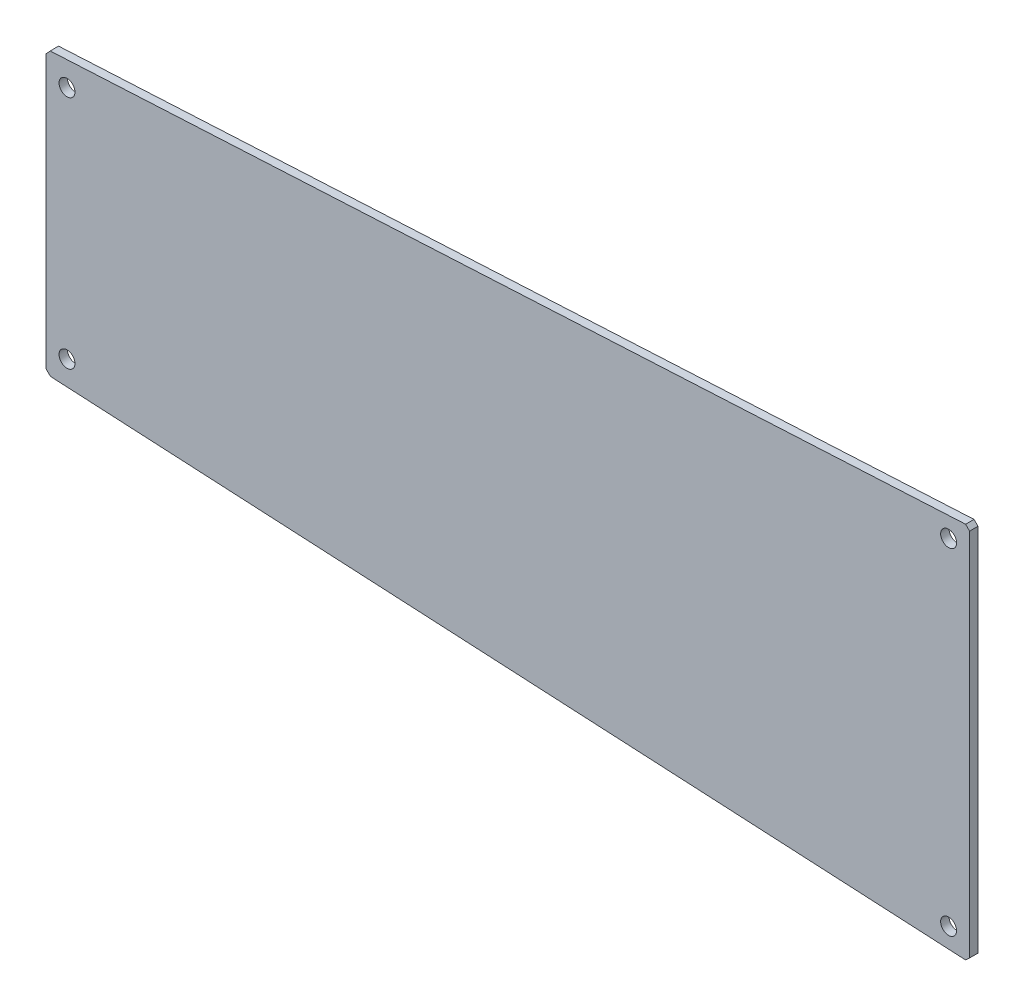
ISO-10303-21;
HEADER;
FILE_DESCRIPTION(('STEP AP214'),'2;1');
FILE_NAME('part.step','',(''),(''),'','','');
FILE_SCHEMA(('AUTOMOTIVE_DESIGN { 1 0 10303 214 1 1 1 1 }'));
ENDSEC;
DATA;
#1=APPLICATION_CONTEXT('core data for automotive mechanical design processes');
#2=APPLICATION_PROTOCOL_DEFINITION('international standard','automotive_design',2000,#1);
#3=PRODUCT_CONTEXT('',#1,'mechanical');
#4=PRODUCT('Part','Part','',(#3));
#5=PRODUCT_RELATED_PRODUCT_CATEGORY('part','',(#4));
#6=PRODUCT_DEFINITION_FORMATION('','',#4);
#7=PRODUCT_DEFINITION_CONTEXT('part definition',#1,'design');
#8=PRODUCT_DEFINITION('design','',#6,#7);
#9=PRODUCT_DEFINITION_SHAPE('','',#8);
#10=(LENGTH_UNIT() NAMED_UNIT(*) SI_UNIT(.MILLI.,.METRE.));
#11=(NAMED_UNIT(*) PLANE_ANGLE_UNIT() SI_UNIT($,.RADIAN.));
#12=(NAMED_UNIT(*) SI_UNIT($,.STERADIAN.) SOLID_ANGLE_UNIT());
#13=UNCERTAINTY_MEASURE_WITH_UNIT(LENGTH_MEASURE(1.E-05),#10,'distance_accuracy_value','');
#14=(GEOMETRIC_REPRESENTATION_CONTEXT(3) GLOBAL_UNCERTAINTY_ASSIGNED_CONTEXT((#13)) GLOBAL_UNIT_ASSIGNED_CONTEXT((#10,
#11,#12)) REPRESENTATION_CONTEXT('',''));
#15=CARTESIAN_POINT('',(0.,0.,0.));
#16=DIRECTION('',(0.,0.,1.));
#17=DIRECTION('',(1.,0.,0.));
#18=AXIS2_PLACEMENT_3D('',#15,#16,#17);
#19=CARTESIAN_POINT('',(-187.107190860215,0.,2.));
#20=DIRECTION('',(0.,0.,1.));
#21=DIRECTION('',(1.,0.,0.));
#22=AXIS2_PLACEMENT_3D('',#19,#20,#21);
#23=PLANE('',#22);
#24=CARTESIAN_POINT('',(-182.107190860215,28.,2.));
#25=DIRECTION('',(0.,0.,1.));
#26=DIRECTION('',(1.,0.,0.));
#27=AXIS2_PLACEMENT_3D('',#24,#25,#26);
#28=CIRCLE('',#27,1.9);
#29=CARTESIAN_POINT('',(-180.207190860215,28.,2.));
#30=VERTEX_POINT('',#29);
#31=EDGE_CURVE('E192',#30,#30,#28,.T.);
#32=ORIENTED_EDGE('',*,*,#31,.F.);
#33=EDGE_LOOP('',(#32));
#34=FACE_BOUND('',#33,.T.);
#35=DIRECTION('',(0.,1.,0.));
#36=VECTOR('',#35,1.);
#37=CARTESIAN_POINT('',(32.8928091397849,0.,2.));
#38=LINE('',#37,#36);
#39=CARTESIAN_POINT('',(32.892809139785,-44.0483785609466,2.));
#40=VERTEX_POINT('',#39);
#41=CARTESIAN_POINT('',(32.8928091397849,44.,2.));
#42=VERTEX_POINT('',#41);
#43=EDGE_CURVE('E119',#40,#42,#38,.T.);
#44=ORIENTED_EDGE('',*,*,#43,.T.);
#45=DIRECTION('',(0.707106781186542,-0.707106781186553,0.));
#46=VECTOR('',#45,1.);
#47=CARTESIAN_POINT('',(-55.1071908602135,132.,2.));
#48=LINE('',#47,#46);
#49=CARTESIAN_POINT('',(31.9424851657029,44.9503239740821,2.));
#50=VERTEX_POINT('',#49);
#51=EDGE_CURVE('E11',#42,#50,#48,.F.);
#52=ORIENTED_EDGE('',*,*,#51,.T.);
#53=DIRECTION('',(-0.998636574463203,-0.0522014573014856,0.));
#54=VECTOR('',#53,1.);
#55=CARTESIAN_POINT('',(32.8928091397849,45.,2.));
#56=LINE('',#55,#54);
#57=CARTESIAN_POINT('',(-186.108554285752,33.5522014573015,2.));
#58=VERTEX_POINT('',#57);
#59=EDGE_CURVE('E122',#50,#58,#56,.T.);
#60=ORIENTED_EDGE('',*,*,#59,.T.);
#61=DIRECTION('',(0.669230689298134,0.743054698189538,0.));
#62=VECTOR('',#61,1.);
#63=CARTESIAN_POINT('',(-203.240484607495,14.5304179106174,2.));
#64=LINE('',#63,#62);
#65=CARTESIAN_POINT('',(-187.107190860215,32.4434035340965,2.));
#66=VERTEX_POINT('',#65);
#67=EDGE_CURVE('E131',#58,#66,#64,.F.);
#68=ORIENTED_EDGE('',*,*,#67,.T.);
#69=DIRECTION('',(0.,-1.,0.));
#70=VECTOR('',#69,1.);
#71=CARTESIAN_POINT('',(-187.107190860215,33.5,2.));
#72=LINE('',#71,#70);
#73=CARTESIAN_POINT('',(-187.107190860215,-32.5,2.));
#74=VERTEX_POINT('',#73);
#75=EDGE_CURVE('E113',#66,#74,#72,.T.);
#76=ORIENTED_EDGE('',*,*,#75,.T.);
#77=DIRECTION('',(-0.707106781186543,0.707106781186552,0.));
#78=VECTOR('',#77,1.);
#79=CARTESIAN_POINT('',(-203.357190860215,-16.2499999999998,2.));
#80=LINE('',#79,#78);
#81=CARTESIAN_POINT('',(-186.052034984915,-33.5551558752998,2.));
#82=VERTEX_POINT('',#81);
#83=EDGE_CURVE('E139',#74,#82,#80,.F.);
#84=ORIENTED_EDGE('',*,*,#83,.T.);
#85=DIRECTION('',(-0.998636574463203,0.0522014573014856,0.));
#86=VECTOR('',#85,1.);
#87=CARTESIAN_POINT('',(32.8928091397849,-45.,2.));
#88=LINE('',#87,#86);
#89=CARTESIAN_POINT('',(31.8941725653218,-44.9477985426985,2.));
#90=VERTEX_POINT('',#89);
#91=EDGE_CURVE('E174',#90,#82,#88,.T.);
#92=ORIENTED_EDGE('',*,*,#91,.F.);
#93=DIRECTION('',(-0.743054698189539,-0.669230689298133,0.));
#94=VECTOR('',#93,1.);
#95=CARTESIAN_POINT('',(-66.6716956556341,-133.720945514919,2.));
#96=LINE('',#95,#94);
#97=EDGE_CURVE('E149',#90,#40,#96,.F.);
#98=ORIENTED_EDGE('',*,*,#97,.T.);
#99=EDGE_LOOP('',(#44,#52,#60,#68,#76,#84,#92,#98));
#100=FACE_BOUND('',#99,.T.);
#101=CARTESIAN_POINT('',(27.892809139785,40.,2.));
#102=DIRECTION('',(0.,0.,1.));
#103=DIRECTION('',(1.,0.,0.));
#104=AXIS2_PLACEMENT_3D('',#101,#102,#103);
#105=CIRCLE('',#104,1.9);
#106=CARTESIAN_POINT('',(29.792809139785,40.,2.));
#107=VERTEX_POINT('',#106);
#108=EDGE_CURVE('E186',#107,#107,#105,.T.);
#109=ORIENTED_EDGE('',*,*,#108,.F.);
#110=EDGE_LOOP('',(#109));
#111=FACE_BOUND('',#110,.T.);
#112=CARTESIAN_POINT('',(-182.107190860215,-28.,2.));
#113=DIRECTION('',(0.,0.,-1.));
#114=DIRECTION('',(1.,0.,0.));
#115=AXIS2_PLACEMENT_3D('',#112,#113,#114);
#116=CIRCLE('',#115,1.9);
#117=CARTESIAN_POINT('',(-180.207190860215,-28.,2.));
#118=VERTEX_POINT('',#117);
#119=EDGE_CURVE('E175',#118,#118,#116,.T.);
#120=ORIENTED_EDGE('',*,*,#119,.T.);
#121=EDGE_LOOP('',(#120));
#122=FACE_BOUND('',#121,.T.);
#123=CARTESIAN_POINT('',(27.892809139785,-40.,2.));
#124=DIRECTION('',(0.,0.,-1.));
#125=DIRECTION('',(1.,0.,0.));
#126=AXIS2_PLACEMENT_3D('',#123,#124,#125);
#127=CIRCLE('',#126,1.9);
#128=CARTESIAN_POINT('',(29.792809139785,-40.,2.));
#129=VERTEX_POINT('',#128);
#130=EDGE_CURVE('E341',#129,#129,#127,.T.);
#131=ORIENTED_EDGE('',*,*,#130,.T.);
#132=EDGE_LOOP('',(#131));
#133=FACE_BOUND('',#132,.T.);
#134=ADVANCED_FACE('F31',(#34,#100,#111,#122,#133),#23,.T.);
#135=CARTESIAN_POINT('',(-187.107190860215,0.,0.));
#136=DIRECTION('',(0.,0.,1.));
#137=DIRECTION('',(1.,0.,0.));
#138=AXIS2_PLACEMENT_3D('',#135,#136,#137);
#139=PLANE('',#138);
#140=CARTESIAN_POINT('',(-182.107190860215,28.,0.));
#141=DIRECTION('',(0.,0.,1.));
#142=DIRECTION('',(1.,0.,0.));
#143=AXIS2_PLACEMENT_3D('',#140,#141,#142);
#144=CIRCLE('',#143,1.9);
#145=CARTESIAN_POINT('',(-180.207190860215,28.,0.));
#146=VERTEX_POINT('',#145);
#147=EDGE_CURVE('E189',#146,#146,#144,.T.);
#148=ORIENTED_EDGE('',*,*,#147,.T.);
#149=EDGE_LOOP('',(#148));
#150=FACE_BOUND('',#149,.T.);
#151=DIRECTION('',(-0.998636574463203,-0.0522014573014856,0.));
#152=VECTOR('',#151,1.);
#153=CARTESIAN_POINT('',(32.8928091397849,45.,0.));
#154=LINE('',#153,#152);
#155=CARTESIAN_POINT('',(31.9424851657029,44.9503239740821,0.));
#156=VERTEX_POINT('',#155);
#157=CARTESIAN_POINT('',(-186.108554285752,33.5522014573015,0.));
#158=VERTEX_POINT('',#157);
#159=EDGE_CURVE('E120',#156,#158,#154,.T.);
#160=ORIENTED_EDGE('',*,*,#159,.F.);
#161=DIRECTION('',(-0.707106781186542,0.707106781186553,0.));
#162=VECTOR('',#161,1.);
#163=CARTESIAN_POINT('',(31.9424851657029,44.9503239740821,0.));
#164=LINE('',#163,#162);
#165=CARTESIAN_POINT('',(32.8928091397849,44.,0.));
#166=VERTEX_POINT('',#165);
#167=EDGE_CURVE('E53',#156,#166,#164,.F.);
#168=ORIENTED_EDGE('',*,*,#167,.T.);
#169=DIRECTION('',(0.,1.,0.));
#170=VECTOR('',#169,1.);
#171=CARTESIAN_POINT('',(32.8928091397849,0.,0.));
#172=LINE('',#171,#170);
#173=CARTESIAN_POINT('',(32.8928091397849,-44.0483785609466,0.));
#174=VERTEX_POINT('',#173);
#175=EDGE_CURVE('E124',#174,#166,#172,.T.);
#176=ORIENTED_EDGE('',*,*,#175,.F.);
#177=DIRECTION('',(0.743054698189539,0.669230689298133,0.));
#178=VECTOR('',#177,1.);
#179=CARTESIAN_POINT('',(32.8928091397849,-44.0483785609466,0.));
#180=LINE('',#179,#178);
#181=CARTESIAN_POINT('',(31.8941725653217,-44.9477985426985,0.));
#182=VERTEX_POINT('',#181);
#183=EDGE_CURVE('E145',#174,#182,#180,.F.);
#184=ORIENTED_EDGE('',*,*,#183,.T.);
#185=DIRECTION('',(-0.998636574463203,0.0522014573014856,0.));
#186=VECTOR('',#185,1.);
#187=CARTESIAN_POINT('',(32.8928091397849,-45.,0.));
#188=LINE('',#187,#186);
#189=CARTESIAN_POINT('',(-186.052034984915,-33.5551558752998,0.));
#190=VERTEX_POINT('',#189);
#191=EDGE_CURVE('E170',#182,#190,#188,.T.);
#192=ORIENTED_EDGE('',*,*,#191,.T.);
#193=DIRECTION('',(0.707106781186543,-0.707106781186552,0.));
#194=VECTOR('',#193,1.);
#195=CARTESIAN_POINT('',(-186.052034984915,-33.5551558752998,0.));
#196=LINE('',#195,#194);
#197=CARTESIAN_POINT('',(-187.107190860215,-32.4999999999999,0.));
#198=VERTEX_POINT('',#197);
#199=EDGE_CURVE('E118',#190,#198,#196,.F.);
#200=ORIENTED_EDGE('',*,*,#199,.T.);
#201=DIRECTION('',(0.,-1.,0.));
#202=VECTOR('',#201,1.);
#203=CARTESIAN_POINT('',(-187.107190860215,33.5,0.));
#204=LINE('',#203,#202);
#205=CARTESIAN_POINT('',(-187.107190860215,32.4434035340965,0.));
#206=VERTEX_POINT('',#205);
#207=EDGE_CURVE('E110',#206,#198,#204,.T.);
#208=ORIENTED_EDGE('',*,*,#207,.F.);
#209=DIRECTION('',(-0.669230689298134,-0.743054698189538,0.));
#210=VECTOR('',#209,1.);
#211=CARTESIAN_POINT('',(-187.107190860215,32.4434035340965,0.));
#212=LINE('',#211,#210);
#213=EDGE_CURVE('E97',#206,#158,#212,.F.);
#214=ORIENTED_EDGE('',*,*,#213,.T.);
#215=EDGE_LOOP('',(#160,#168,#176,#184,#192,#200,#208,#214));
#216=FACE_BOUND('',#215,.T.);
#217=CARTESIAN_POINT('',(27.892809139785,40.,0.));
#218=DIRECTION('',(0.,0.,1.));
#219=DIRECTION('',(1.,0.,0.));
#220=AXIS2_PLACEMENT_3D('',#217,#218,#219);
#221=CIRCLE('',#220,1.9);
#222=CARTESIAN_POINT('',(29.792809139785,40.,0.));
#223=VERTEX_POINT('',#222);
#224=EDGE_CURVE('E177',#223,#223,#221,.T.);
#225=ORIENTED_EDGE('',*,*,#224,.T.);
#226=EDGE_LOOP('',(#225));
#227=FACE_BOUND('',#226,.T.);
#228=CARTESIAN_POINT('',(-182.107190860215,-28.,0.));
#229=DIRECTION('',(0.,0.,-1.));
#230=DIRECTION('',(1.,0.,0.));
#231=AXIS2_PLACEMENT_3D('',#228,#229,#230);
#232=CIRCLE('',#231,1.9);
#233=CARTESIAN_POINT('',(-180.207190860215,-28.,0.));
#234=VERTEX_POINT('',#233);
#235=EDGE_CURVE('E180',#234,#234,#232,.T.);
#236=ORIENTED_EDGE('',*,*,#235,.F.);
#237=EDGE_LOOP('',(#236));
#238=FACE_BOUND('',#237,.T.);
#239=CARTESIAN_POINT('',(27.892809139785,-40.,0.));
#240=DIRECTION('',(0.,0.,-1.));
#241=DIRECTION('',(1.,0.,0.));
#242=AXIS2_PLACEMENT_3D('',#239,#240,#241);
#243=CIRCLE('',#242,1.9);
#244=CARTESIAN_POINT('',(29.792809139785,-40.,0.));
#245=VERTEX_POINT('',#244);
#246=EDGE_CURVE('E339',#245,#245,#243,.T.);
#247=ORIENTED_EDGE('',*,*,#246,.F.);
#248=EDGE_LOOP('',(#247));
#249=FACE_BOUND('',#248,.T.);
#250=ADVANCED_FACE('F115',(#150,#216,#227,#238,#249),#139,.F.);
#251=CARTESIAN_POINT('',(32.8928091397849,0.,2.));
#252=DIRECTION('',(-1.,0.,0.));
#253=DIRECTION('',(0.,0.,1.));
#254=AXIS2_PLACEMENT_3D('',#251,#252,#253);
#255=PLANE('',#254);
#256=ORIENTED_EDGE('',*,*,#175,.T.);
#257=DIRECTION('',(0.,0.,1.));
#258=VECTOR('',#257,1.);
#259=CARTESIAN_POINT('',(32.8928091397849,44.,2.));
#260=LINE('',#259,#258);
#261=EDGE_CURVE('E39',#166,#42,#260,.T.);
#262=ORIENTED_EDGE('',*,*,#261,.T.);
#263=ORIENTED_EDGE('',*,*,#43,.F.);
#264=DIRECTION('',(0.,0.,-1.));
#265=VECTOR('',#264,1.);
#266=CARTESIAN_POINT('',(32.8928091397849,-44.0483785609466,2.));
#267=LINE('',#266,#265);
#268=EDGE_CURVE('E142',#40,#174,#267,.T.);
#269=ORIENTED_EDGE('',*,*,#268,.T.);
#270=EDGE_LOOP('',(#256,#262,#263,#269));
#271=FACE_BOUND('',#270,.T.);
#272=ADVANCED_FACE('F33',(#271),#255,.F.);
#273=CARTESIAN_POINT('',(32.8928091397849,45.,2.));
#274=DIRECTION('',(0.0522014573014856,-0.998636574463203,0.));
#275=DIRECTION('',(0.998636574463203,0.0522014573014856,0.));
#276=AXIS2_PLACEMENT_3D('',#273,#274,#275);
#277=PLANE('',#276);
#278=ORIENTED_EDGE('',*,*,#59,.F.);
#279=DIRECTION('',(0.,0.,-1.));
#280=VECTOR('',#279,1.);
#281=CARTESIAN_POINT('',(31.9424851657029,44.9503239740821,2.));
#282=LINE('',#281,#280);
#283=EDGE_CURVE('E151',#50,#156,#282,.T.);
#284=ORIENTED_EDGE('',*,*,#283,.T.);
#285=ORIENTED_EDGE('',*,*,#159,.T.);
#286=DIRECTION('',(0.,0.,1.));
#287=VECTOR('',#286,1.);
#288=CARTESIAN_POINT('',(-186.108554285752,33.5522014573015,2.));
#289=LINE('',#288,#287);
#290=EDGE_CURVE('E103',#158,#58,#289,.T.);
#291=ORIENTED_EDGE('',*,*,#290,.T.);
#292=EDGE_LOOP('',(#278,#284,#285,#291));
#293=FACE_BOUND('',#292,.T.);
#294=ADVANCED_FACE('F157',(#293),#277,.F.);
#295=CARTESIAN_POINT('',(-187.107190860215,33.5,2.));
#296=DIRECTION('',(1.,0.,0.));
#297=DIRECTION('',(0.,0.,-1.));
#298=AXIS2_PLACEMENT_3D('',#295,#296,#297);
#299=PLANE('',#298);
#300=ORIENTED_EDGE('',*,*,#207,.T.);
#301=DIRECTION('',(0.,0.,1.));
#302=VECTOR('',#301,1.);
#303=CARTESIAN_POINT('',(-187.107190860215,-32.4999999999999,2.));
#304=LINE('',#303,#302);
#305=EDGE_CURVE('E137',#198,#74,#304,.T.);
#306=ORIENTED_EDGE('',*,*,#305,.T.);
#307=ORIENTED_EDGE('',*,*,#75,.F.);
#308=DIRECTION('',(0.,0.,-1.));
#309=VECTOR('',#308,1.);
#310=CARTESIAN_POINT('',(-187.107190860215,32.4434035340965,2.));
#311=LINE('',#310,#309);
#312=EDGE_CURVE('E101',#66,#206,#311,.T.);
#313=ORIENTED_EDGE('',*,*,#312,.T.);
#314=EDGE_LOOP('',(#300,#306,#307,#313));
#315=FACE_BOUND('',#314,.T.);
#316=ADVANCED_FACE('F109',(#315),#299,.F.);
#317=CARTESIAN_POINT('',(-182.107190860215,28.,2.));
#318=DIRECTION('',(0.,0.,-1.));
#319=DIRECTION('',(-1.,0.,0.));
#320=AXIS2_PLACEMENT_3D('',#317,#318,#319);
#321=CYLINDRICAL_SURFACE('',#320,1.9);
#322=ORIENTED_EDGE('',*,*,#31,.T.);
#323=EDGE_LOOP('',(#322));
#324=FACE_BOUND('',#323,.T.);
#325=ORIENTED_EDGE('',*,*,#147,.F.);
#326=EDGE_LOOP('',(#325));
#327=FACE_BOUND('',#326,.T.);
#328=ADVANCED_FACE('F196',(#324,#327),#321,.F.);
#329=CARTESIAN_POINT('',(27.892809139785,40.,2.));
#330=DIRECTION('',(0.,0.,-1.));
#331=DIRECTION('',(-1.,0.,0.));
#332=AXIS2_PLACEMENT_3D('',#329,#330,#331);
#333=CYLINDRICAL_SURFACE('',#332,1.9);
#334=ORIENTED_EDGE('',*,*,#108,.T.);
#335=EDGE_LOOP('',(#334));
#336=FACE_BOUND('',#335,.T.);
#337=ORIENTED_EDGE('',*,*,#224,.F.);
#338=EDGE_LOOP('',(#337));
#339=FACE_BOUND('',#338,.T.);
#340=ADVANCED_FACE('F249',(#336,#339),#333,.F.);
#341=CARTESIAN_POINT('',(32.8928091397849,-45.,2.));
#342=DIRECTION('',(0.0522014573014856,0.998636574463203,0.));
#343=DIRECTION('',(0.998636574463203,-0.0522014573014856,0.));
#344=AXIS2_PLACEMENT_3D('',#341,#342,#343);
#345=PLANE('',#344);
#346=ORIENTED_EDGE('',*,*,#191,.F.);
#347=DIRECTION('',(0.,0.,1.));
#348=VECTOR('',#347,1.);
#349=CARTESIAN_POINT('',(31.8941725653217,-44.9477985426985,2.));
#350=LINE('',#349,#348);
#351=EDGE_CURVE('E147',#182,#90,#350,.T.);
#352=ORIENTED_EDGE('',*,*,#351,.T.);
#353=ORIENTED_EDGE('',*,*,#91,.T.);
#354=DIRECTION('',(0.,0.,-1.));
#355=VECTOR('',#354,1.);
#356=CARTESIAN_POINT('',(-186.052034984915,-33.5551558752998,2.));
#357=LINE('',#356,#355);
#358=EDGE_CURVE('E133',#82,#190,#357,.T.);
#359=ORIENTED_EDGE('',*,*,#358,.T.);
#360=EDGE_LOOP('',(#346,#352,#353,#359));
#361=FACE_BOUND('',#360,.T.);
#362=ADVANCED_FACE('F172',(#361),#345,.F.);
#363=CARTESIAN_POINT('',(-182.107190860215,-28.,2.));
#364=DIRECTION('',(0.,0.,-1.));
#365=DIRECTION('',(-1.,0.,0.));
#366=AXIS2_PLACEMENT_3D('',#363,#364,#365);
#367=CYLINDRICAL_SURFACE('',#366,1.9);
#368=ORIENTED_EDGE('',*,*,#119,.F.);
#369=EDGE_LOOP('',(#368));
#370=FACE_BOUND('',#369,.T.);
#371=ORIENTED_EDGE('',*,*,#235,.T.);
#372=EDGE_LOOP('',(#371));
#373=FACE_BOUND('',#372,.T.);
#374=ADVANCED_FACE('F248',(#370,#373),#367,.F.);
#375=CARTESIAN_POINT('',(27.892809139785,-40.,2.));
#376=DIRECTION('',(0.,0.,-1.));
#377=DIRECTION('',(-1.,0.,0.));
#378=AXIS2_PLACEMENT_3D('',#375,#376,#377);
#379=CYLINDRICAL_SURFACE('',#378,1.9);
#380=ORIENTED_EDGE('',*,*,#130,.F.);
#381=EDGE_LOOP('',(#380));
#382=FACE_BOUND('',#381,.T.);
#383=ORIENTED_EDGE('',*,*,#246,.T.);
#384=EDGE_LOOP('',(#383));
#385=FACE_BOUND('',#384,.T.);
#386=ADVANCED_FACE('F276',(#382,#385),#379,.F.);
#387=CARTESIAN_POINT('',(-187.107190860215,32.4434035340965,2.));
#388=DIRECTION('',(0.743054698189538,-0.669230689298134,0.));
#389=DIRECTION('',(0.669230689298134,0.743054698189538,0.));
#390=AXIS2_PLACEMENT_3D('',#387,#388,#389);
#391=PLANE('',#390);
#392=ORIENTED_EDGE('',*,*,#67,.F.);
#393=ORIENTED_EDGE('',*,*,#290,.F.);
#394=ORIENTED_EDGE('',*,*,#213,.F.);
#395=ORIENTED_EDGE('',*,*,#312,.F.);
#396=EDGE_LOOP('',(#392,#393,#394,#395));
#397=FACE_BOUND('',#396,.T.);
#398=ADVANCED_FACE('F100',(#397),#391,.F.);
#399=CARTESIAN_POINT('',(-186.052034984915,-33.5551558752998,2.));
#400=DIRECTION('',(0.707106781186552,0.707106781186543,0.));
#401=DIRECTION('',(-0.707106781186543,0.707106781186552,0.));
#402=AXIS2_PLACEMENT_3D('',#399,#400,#401);
#403=PLANE('',#402);
#404=ORIENTED_EDGE('',*,*,#83,.F.);
#405=ORIENTED_EDGE('',*,*,#305,.F.);
#406=ORIENTED_EDGE('',*,*,#199,.F.);
#407=ORIENTED_EDGE('',*,*,#358,.F.);
#408=EDGE_LOOP('',(#404,#405,#406,#407));
#409=FACE_BOUND('',#408,.T.);
#410=ADVANCED_FACE('F235',(#409),#403,.F.);
#411=CARTESIAN_POINT('',(32.8928091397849,-44.0483785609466,2.));
#412=DIRECTION('',(-0.669230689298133,0.743054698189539,0.));
#413=DIRECTION('',(-0.743054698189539,-0.669230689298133,0.));
#414=AXIS2_PLACEMENT_3D('',#411,#412,#413);
#415=PLANE('',#414);
#416=ORIENTED_EDGE('',*,*,#97,.F.);
#417=ORIENTED_EDGE('',*,*,#351,.F.);
#418=ORIENTED_EDGE('',*,*,#183,.F.);
#419=ORIENTED_EDGE('',*,*,#268,.F.);
#420=EDGE_LOOP('',(#416,#417,#418,#419));
#421=FACE_BOUND('',#420,.T.);
#422=ADVANCED_FACE('F167',(#421),#415,.F.);
#423=CARTESIAN_POINT('',(31.9424851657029,44.9503239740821,2.));
#424=DIRECTION('',(-0.707106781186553,-0.707106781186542,0.));
#425=DIRECTION('',(0.707106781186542,-0.707106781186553,0.));
#426=AXIS2_PLACEMENT_3D('',#423,#424,#425);
#427=PLANE('',#426);
#428=ORIENTED_EDGE('',*,*,#51,.F.);
#429=ORIENTED_EDGE('',*,*,#261,.F.);
#430=ORIENTED_EDGE('',*,*,#167,.F.);
#431=ORIENTED_EDGE('',*,*,#283,.F.);
#432=EDGE_LOOP('',(#428,#429,#430,#431));
#433=FACE_BOUND('',#432,.T.);
#434=ADVANCED_FACE('F160',(#433),#427,.F.);
#435=CLOSED_SHELL('',(#134,#250,#272,#294,#316,#328,#340,#362,#374,#386,#398,#410,#422,#434));
#436=MANIFOLD_SOLID_BREP('B2',#435);
#437=ADVANCED_BREP_SHAPE_REPRESENTATION('',(#18,#436),#14);
#438=SHAPE_DEFINITION_REPRESENTATION(#9,#437);
ENDSEC;
END-ISO-10303-21;
